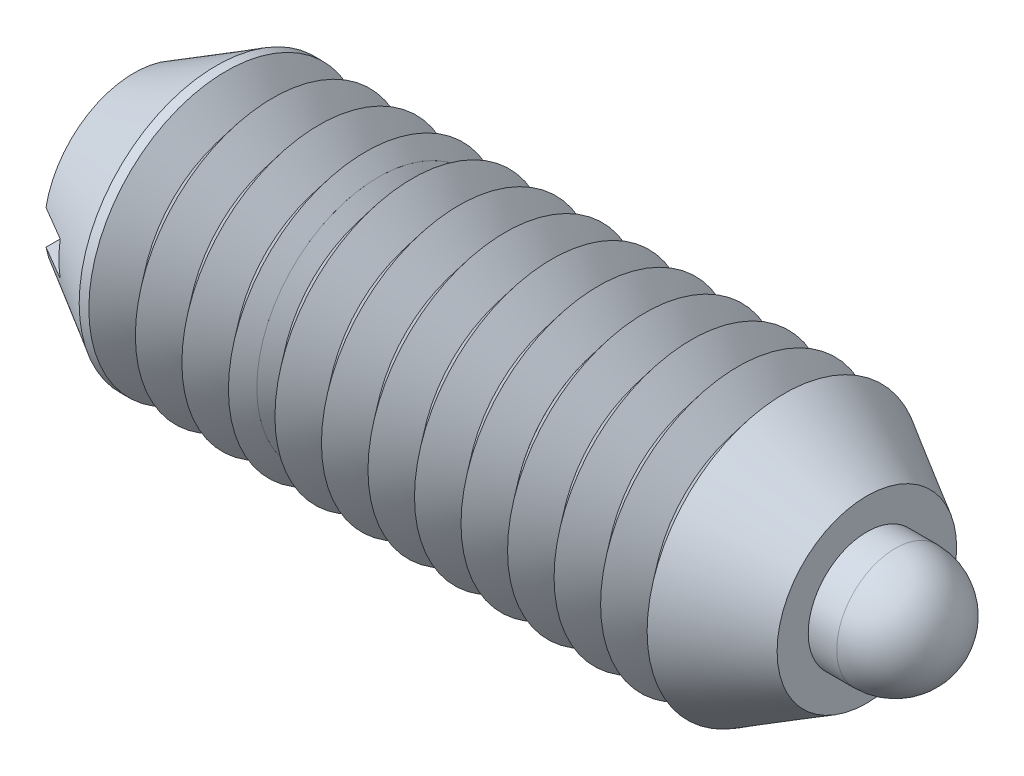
ISO-10303-21;
HEADER;
FILE_DESCRIPTION(('STEP AP214'),'2;1');
FILE_NAME('part.step','',(''),(''),'','','');
FILE_SCHEMA(('AUTOMOTIVE_DESIGN { 1 0 10303 214 1 1 1 1 }'));
ENDSEC;
DATA;
#1=APPLICATION_CONTEXT('core data for automotive mechanical design processes');
#2=APPLICATION_PROTOCOL_DEFINITION('international standard','automotive_design',2000,#1);
#3=PRODUCT_CONTEXT('',#1,'mechanical');
#4=PRODUCT('Part','Part','',(#3));
#5=PRODUCT_RELATED_PRODUCT_CATEGORY('part','',(#4));
#6=PRODUCT_DEFINITION_FORMATION('','',#4);
#7=PRODUCT_DEFINITION_CONTEXT('part definition',#1,'design');
#8=PRODUCT_DEFINITION('design','',#6,#7);
#9=PRODUCT_DEFINITION_SHAPE('','',#8);
#10=(LENGTH_UNIT() NAMED_UNIT(*) SI_UNIT(.MILLI.,.METRE.));
#11=(NAMED_UNIT(*) PLANE_ANGLE_UNIT() SI_UNIT($,.RADIAN.));
#12=(NAMED_UNIT(*) SI_UNIT($,.STERADIAN.) SOLID_ANGLE_UNIT());
#13=UNCERTAINTY_MEASURE_WITH_UNIT(LENGTH_MEASURE(1.E-05),#10,'distance_accuracy_value','');
#14=(GEOMETRIC_REPRESENTATION_CONTEXT(3) GLOBAL_UNCERTAINTY_ASSIGNED_CONTEXT((#13)) GLOBAL_UNIT_ASSIGNED_CONTEXT((#10,
#11,#12)) REPRESENTATION_CONTEXT('',''));
#15=CARTESIAN_POINT('',(0.,0.,0.));
#16=DIRECTION('',(0.,0.,1.));
#17=DIRECTION('',(1.,0.,0.));
#18=AXIS2_PLACEMENT_3D('',#15,#16,#17);
#19=CARTESIAN_POINT('',(9.0678,0.,0.));
#20=DIRECTION('',(-1.,0.,0.));
#21=DIRECTION('',(0.,-0.719424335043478,-0.694570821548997));
#22=AXIS2_PLACEMENT_3D('',#19,#20,#21);
#23=PLANE('',#22);
#24=CARTESIAN_POINT('',(9.0678,0.,0.));
#25=DIRECTION('',(1.,0.,0.));
#26=DIRECTION('',(0.,0.719424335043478,0.694570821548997));
#27=AXIS2_PLACEMENT_3D('',#24,#25,#26);
#28=CIRCLE('',#27,0.889);
#29=CARTESIAN_POINT('',(9.0678,0.639568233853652,0.617473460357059));
#30=VERTEX_POINT('',#29);
#31=EDGE_CURVE('P0_E10',#30,#30,#28,.T.);
#32=ORIENTED_EDGE('',*,*,#31,.F.);
#33=EDGE_LOOP('',(#32));
#34=FACE_BOUND('',#33,.T.);
#35=ADVANCED_FACE('P0_F14',(#34),#23,.T.);
#36=CARTESIAN_POINT('',(9.2456,0.,0.));
#37=DIRECTION('',(1.,0.,0.));
#38=DIRECTION('',(0.,0.719424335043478,0.694570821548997));
#39=AXIS2_PLACEMENT_3D('',#36,#37,#38);
#40=CONICAL_SURFACE('',#39,1.0668,0.78539816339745);
#41=ORIENTED_EDGE('',*,*,#31,.T.);
#42=EDGE_LOOP('',(#41));
#43=FACE_BOUND('',#42,.T.);
#44=CARTESIAN_POINT('',(9.2456,0.,0.));
#45=DIRECTION('',(1.,0.,0.));
#46=DIRECTION('',(0.,0.719424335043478,0.694570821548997));
#47=AXIS2_PLACEMENT_3D('',#44,#45,#46);
#48=CIRCLE('',#47,1.0668);
#49=CARTESIAN_POINT('',(9.2456,0.767481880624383,0.740968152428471));
#50=VERTEX_POINT('',#49);
#51=EDGE_CURVE('P0_E20',#50,#50,#48,.T.);
#52=ORIENTED_EDGE('',*,*,#51,.F.);
#53=EDGE_LOOP('',(#52));
#54=FACE_BOUND('',#53,.T.);
#55=ADVANCED_FACE('P0_F54',(#43,#54),#40,.T.);
#56=CARTESIAN_POINT('',(12.4333,0.,0.));
#57=DIRECTION('',(1.,0.,0.));
#58=DIRECTION('',(0.,0.719424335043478,0.694570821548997));
#59=AXIS2_PLACEMENT_3D('',#56,#57,#58);
#60=CYLINDRICAL_SURFACE('',#59,1.0668);
#61=ORIENTED_EDGE('',*,*,#51,.T.);
#62=EDGE_LOOP('',(#61));
#63=FACE_BOUND('',#62,.T.);
#64=CARTESIAN_POINT('',(10.5378413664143,0.,0.));
#65=DIRECTION('',(1.,0.,0.));
#66=DIRECTION('',(0.,0.719424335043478,0.694570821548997));
#67=AXIS2_PLACEMENT_3D('',#64,#65,#66);
#68=CIRCLE('',#67,1.0668);
#69=CARTESIAN_POINT('',(10.5378413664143,0.767481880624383,0.74096815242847));
#70=VERTEX_POINT('',#69);
#71=EDGE_CURVE('P0_E24',#70,#70,#68,.T.);
#72=ORIENTED_EDGE('',*,*,#71,.F.);
#73=EDGE_LOOP('',(#72));
#74=FACE_BOUND('',#73,.T.);
#75=ADVANCED_FACE('P0_F50',(#63,#74),#60,.T.);
#76=CARTESIAN_POINT('',(10.8458,0.,0.));
#77=DIRECTION('',(-1.,0.,0.));
#78=DIRECTION('',(0.,-0.719424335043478,-0.694570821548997));
#79=AXIS2_PLACEMENT_3D('',#76,#77,#78);
#80=CONICAL_SURFACE('',#79,0.889,0.523598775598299);
#81=ORIENTED_EDGE('',*,*,#71,.T.);
#82=EDGE_LOOP('',(#81));
#83=FACE_BOUND('',#82,.T.);
#84=CARTESIAN_POINT('',(10.8458,0.,0.));
#85=DIRECTION('',(1.,0.,0.));
#86=DIRECTION('',(0.,0.719424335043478,0.694570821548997));
#87=AXIS2_PLACEMENT_3D('',#84,#85,#86);
#88=CIRCLE('',#87,0.889);
#89=CARTESIAN_POINT('',(10.8458,0.639568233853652,0.617473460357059));
#90=VERTEX_POINT('',#89);
#91=EDGE_CURVE('P0_E28',#90,#90,#88,.T.);
#92=ORIENTED_EDGE('',*,*,#91,.F.);
#93=EDGE_LOOP('',(#92));
#94=FACE_BOUND('',#93,.T.);
#95=ADVANCED_FACE('P0_F41',(#83,#94),#80,.T.);
#96=CARTESIAN_POINT('',(12.4333,0.,0.));
#97=DIRECTION('',(1.,0.,0.));
#98=DIRECTION('',(0.,0.719424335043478,0.694570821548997));
#99=AXIS2_PLACEMENT_3D('',#96,#97,#98);
#100=CYLINDRICAL_SURFACE('',#99,0.889);
#101=ORIENTED_EDGE('',*,*,#91,.T.);
#102=EDGE_LOOP('',(#101));
#103=FACE_BOUND('',#102,.T.);
#104=CARTESIAN_POINT('',(11.5443,0.,0.));
#105=DIRECTION('',(1.,0.,0.));
#106=DIRECTION('',(0.,0.719424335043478,0.694570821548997));
#107=AXIS2_PLACEMENT_3D('',#104,#105,#106);
#108=CIRCLE('',#107,0.889);
#109=CARTESIAN_POINT('',(11.5443,0.639568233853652,0.617473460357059));
#110=VERTEX_POINT('',#109);
#111=EDGE_CURVE('P0_E33',#110,#110,#108,.T.);
#112=ORIENTED_EDGE('',*,*,#111,.F.);
#113=EDGE_LOOP('',(#112));
#114=FACE_BOUND('',#113,.T.);
#115=ADVANCED_FACE('P0_F39',(#103,#114),#100,.T.);
#116=CARTESIAN_POINT('',(11.5443,0.,0.));
#117=DIRECTION('',(1.,0.,0.));
#118=DIRECTION('',(0.,-0.719424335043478,-0.694570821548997));
#119=AXIS2_PLACEMENT_3D('',#116,#117,#118);
#120=SPHERICAL_SURFACE('',#119,0.889);
#121=ORIENTED_EDGE('',*,*,#111,.T.);
#122=EDGE_LOOP('',(#121));
#123=FACE_BOUND('',#122,.T.);
#124=ADVANCED_FACE('P0_F37',(#123),#120,.T.);
#125=CLOSED_SHELL('',(#35,#55,#75,#95,#115,#124));
#126=MANIFOLD_SOLID_BREP('P0_B1',#125);
#127=CARTESIAN_POINT('',(3.70416666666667,4.1656,-2.0828));
#128=DIRECTION('',(-1.,0.,0.));
#129=DIRECTION('',(0.,-1.,0.));
#130=AXIS2_PLACEMENT_3D('',#127,#128,#129);
#131=PLANE('',#130);
#132=CARTESIAN_POINT('',(3.70416666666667,0.,0.));
#133=DIRECTION('',(-1.,0.,0.));
#134=DIRECTION('',(0.,-1.,0.));
#135=AXIS2_PLACEMENT_3D('',#132,#133,#134);
#136=CIRCLE('',#135,1.84380808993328);
#137=CARTESIAN_POINT('',(3.70416666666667,-1.84380808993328,0.));
#138=VERTEX_POINT('',#137);
#139=EDGE_CURVE('P1_E31',#138,#138,#136,.F.);
#140=ORIENTED_EDGE('',*,*,#139,.F.);
#141=EDGE_LOOP('',(#140));
#142=FACE_BOUND('',#141,.T.);
#143=CARTESIAN_POINT('',(3.70416666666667,0.,0.));
#144=DIRECTION('',(1.,0.,0.));
#145=DIRECTION('',(0.,0.,-1.));
#146=AXIS2_PLACEMENT_3D('',#143,#144,#145);
#147=CIRCLE('',#146,1.0922);
#148=CARTESIAN_POINT('',(3.70416666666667,0.,-1.0922));
#149=VERTEX_POINT('',#148);
#150=EDGE_CURVE('P1_E47',#149,#149,#147,.T.);
#151=ORIENTED_EDGE('',*,*,#150,.T.);
#152=EDGE_LOOP('',(#151));
#153=FACE_BOUND('',#152,.T.);
#154=ADVANCED_FACE('P1_F14',(#142,#153),#131,.T.);
#155=CARTESIAN_POINT('',(7.40833333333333,4.1656,-2.0828));
#156=DIRECTION('',(1.,0.,0.));
#157=DIRECTION('',(0.,1.,0.));
#158=AXIS2_PLACEMENT_3D('',#155,#156,#157);
#159=PLANE('',#158);
#160=CARTESIAN_POINT('',(7.40833333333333,0.,0.));
#161=DIRECTION('',(1.,0.,0.));
#162=DIRECTION('',(0.,1.,0.));
#163=AXIS2_PLACEMENT_3D('',#160,#161,#162);
#164=CIRCLE('',#163,1.66086295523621);
#165=CARTESIAN_POINT('',(7.40833333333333,1.66086295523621,0.));
#166=VERTEX_POINT('',#165);
#167=EDGE_CURVE('P1_E33',#166,#166,#164,.F.);
#168=ORIENTED_EDGE('',*,*,#167,.F.);
#169=EDGE_LOOP('',(#168));
#170=FACE_BOUND('',#169,.T.);
#171=CARTESIAN_POINT('',(7.40833333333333,0.,0.));
#172=DIRECTION('',(1.,0.,0.));
#173=DIRECTION('',(0.,1.,0.));
#174=AXIS2_PLACEMENT_3D('',#171,#172,#173);
#175=CIRCLE('',#174,1.0922);
#176=CARTESIAN_POINT('',(7.40833333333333,1.0922,0.));
#177=VERTEX_POINT('',#176);
#178=EDGE_CURVE('P1_E18',#177,#177,#175,.F.);
#179=ORIENTED_EDGE('',*,*,#178,.T.);
#180=EDGE_LOOP('',(#179));
#181=FACE_BOUND('',#180,.T.);
#182=ADVANCED_FACE('P1_F83',(#170,#181),#159,.T.);
#183=CARTESIAN_POINT('',(5.27670888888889,0.,0.));
#184=DIRECTION('',(1.,0.,0.));
#185=DIRECTION('',(0.,0.,-1.));
#186=AXIS2_PLACEMENT_3D('',#183,#184,#185);
#187=CONICAL_SURFACE('',#186,1.64218069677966,0.895664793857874);
#188=CARTESIAN_POINT('',(5.62948666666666,0.,0.));
#189=DIRECTION('',(-1.,0.,0.));
#190=DIRECTION('',(0.,0.,1.));
#191=AXIS2_PLACEMENT_3D('',#188,#189,#190);
#192=CIRCLE('',#191,2.0828);
#193=CARTESIAN_POINT('',(5.62948666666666,0.,2.0828));
#194=VERTEX_POINT('',#193);
#195=EDGE_CURVE('P1_E54',#194,#194,#192,.T.);
#196=ORIENTED_EDGE('',*,*,#195,.T.);
#197=EDGE_LOOP('',(#196));
#198=FACE_BOUND('',#197,.T.);
#199=CARTESIAN_POINT('',(5.27670888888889,0.,0.));
#200=DIRECTION('',(-1.,0.,0.));
#201=DIRECTION('',(0.,0.,1.));
#202=AXIS2_PLACEMENT_3D('',#199,#200,#201);
#203=CIRCLE('',#202,1.64218069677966);
#204=CARTESIAN_POINT('',(5.27670888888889,0.,1.64218069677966));
#205=VERTEX_POINT('',#204);
#206=EDGE_CURVE('P1_E57',#205,#205,#203,.T.);
#207=ORIENTED_EDGE('',*,*,#206,.F.);
#208=EDGE_LOOP('',(#207));
#209=FACE_BOUND('',#208,.T.);
#210=ADVANCED_FACE('P1_F89',(#198,#209),#187,.T.);
#211=CARTESIAN_POINT('',(4.92393111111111,0.,0.));
#212=DIRECTION('',(-1.,0.,0.));
#213=DIRECTION('',(0.,0.,1.));
#214=AXIS2_PLACEMENT_3D('',#211,#212,#213);
#215=CONICAL_SURFACE('',#214,2.0828,0.895664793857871);
#216=ORIENTED_EDGE('',*,*,#206,.T.);
#217=EDGE_LOOP('',(#216));
#218=FACE_BOUND('',#217,.T.);
#219=CARTESIAN_POINT('',(4.92393111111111,0.,0.));
#220=DIRECTION('',(-1.,0.,0.));
#221=DIRECTION('',(0.,0.,1.));
#222=AXIS2_PLACEMENT_3D('',#219,#220,#221);
#223=CIRCLE('',#222,2.0828);
#224=CARTESIAN_POINT('',(4.92393111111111,0.,2.0828));
#225=VERTEX_POINT('',#224);
#226=EDGE_CURVE('P1_E44',#225,#225,#223,.T.);
#227=ORIENTED_EDGE('',*,*,#226,.F.);
#228=EDGE_LOOP('',(#227));
#229=FACE_BOUND('',#228,.T.);
#230=ADVANCED_FACE('P1_F111',(#218,#229),#215,.T.);
#231=CARTESIAN_POINT('',(4.57115333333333,0.,0.));
#232=DIRECTION('',(1.,0.,0.));
#233=DIRECTION('',(0.,0.,-1.));
#234=AXIS2_PLACEMENT_3D('',#231,#232,#233);
#235=CONICAL_SURFACE('',#234,1.64218069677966,0.895664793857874);
#236=ORIENTED_EDGE('',*,*,#226,.T.);
#237=EDGE_LOOP('',(#236));
#238=FACE_BOUND('',#237,.T.);
#239=CARTESIAN_POINT('',(4.57115333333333,0.,0.));
#240=DIRECTION('',(-1.,0.,0.));
#241=DIRECTION('',(0.,0.,1.));
#242=AXIS2_PLACEMENT_3D('',#239,#240,#241);
#243=CIRCLE('',#242,1.64218069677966);
#244=CARTESIAN_POINT('',(4.57115333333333,0.,1.64218069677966));
#245=VERTEX_POINT('',#244);
#246=EDGE_CURVE('P1_E51',#245,#245,#243,.T.);
#247=ORIENTED_EDGE('',*,*,#246,.F.);
#248=EDGE_LOOP('',(#247));
#249=FACE_BOUND('',#248,.T.);
#250=ADVANCED_FACE('P1_F107',(#238,#249),#235,.T.);
#251=CARTESIAN_POINT('',(4.21837555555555,0.,0.));
#252=DIRECTION('',(-1.,0.,0.));
#253=DIRECTION('',(0.,0.,1.));
#254=AXIS2_PLACEMENT_3D('',#251,#252,#253);
#255=CONICAL_SURFACE('',#254,2.0828,0.895664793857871);
#256=ORIENTED_EDGE('',*,*,#246,.T.);
#257=EDGE_LOOP('',(#256));
#258=FACE_BOUND('',#257,.T.);
#259=CARTESIAN_POINT('',(4.21837555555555,0.,0.));
#260=DIRECTION('',(-1.,0.,0.));
#261=DIRECTION('',(0.,0.,1.));
#262=AXIS2_PLACEMENT_3D('',#259,#260,#261);
#263=CIRCLE('',#262,2.0828);
#264=CARTESIAN_POINT('',(4.21837555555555,0.,2.0828));
#265=VERTEX_POINT('',#264);
#266=EDGE_CURVE('P1_E35',#265,#265,#263,.T.);
#267=ORIENTED_EDGE('',*,*,#266,.F.);
#268=EDGE_LOOP('',(#267));
#269=FACE_BOUND('',#268,.T.);
#270=ADVANCED_FACE('P1_F104',(#258,#269),#255,.T.);
#271=CARTESIAN_POINT('',(3.86559777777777,0.,0.));
#272=DIRECTION('',(1.,0.,0.));
#273=DIRECTION('',(0.,0.,-1.));
#274=AXIS2_PLACEMENT_3D('',#271,#272,#273);
#275=CONICAL_SURFACE('',#274,1.64218069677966,0.895664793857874);
#276=ORIENTED_EDGE('',*,*,#266,.T.);
#277=EDGE_LOOP('',(#276));
#278=FACE_BOUND('',#277,.T.);
#279=CARTESIAN_POINT('',(3.86559777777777,0.,0.));
#280=DIRECTION('',(-1.,0.,0.));
#281=DIRECTION('',(0.,0.,1.));
#282=AXIS2_PLACEMENT_3D('',#279,#280,#281);
#283=CIRCLE('',#282,1.64218069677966);
#284=CARTESIAN_POINT('',(3.86559777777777,0.,1.64218069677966));
#285=VERTEX_POINT('',#284);
#286=EDGE_CURVE('P1_E39',#285,#285,#283,.T.);
#287=ORIENTED_EDGE('',*,*,#286,.F.);
#288=EDGE_LOOP('',(#287));
#289=FACE_BOUND('',#288,.T.);
#290=ADVANCED_FACE('P1_F100',(#278,#289),#275,.T.);
#291=CARTESIAN_POINT('',(3.51282,0.,0.));
#292=DIRECTION('',(-1.,0.,0.));
#293=DIRECTION('',(0.,0.,1.));
#294=AXIS2_PLACEMENT_3D('',#291,#292,#293);
#295=CONICAL_SURFACE('',#294,2.0828,0.895664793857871);
#296=ORIENTED_EDGE('',*,*,#286,.T.);
#297=EDGE_LOOP('',(#296));
#298=FACE_BOUND('',#297,.T.);
#299=ORIENTED_EDGE('',*,*,#139,.T.);
#300=EDGE_LOOP('',(#299));
#301=FACE_BOUND('',#300,.T.);
#302=ADVANCED_FACE('P1_F96',(#298,#301),#295,.T.);
#303=CARTESIAN_POINT('',(5.62948666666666,0.,0.));
#304=DIRECTION('',(-1.,0.,0.));
#305=DIRECTION('',(0.,0.,1.));
#306=AXIS2_PLACEMENT_3D('',#303,#304,#305);
#307=CONICAL_SURFACE('',#306,2.0828,0.895664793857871);
#308=CARTESIAN_POINT('',(5.98226444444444,0.,0.));
#309=DIRECTION('',(-1.,0.,0.));
#310=DIRECTION('',(0.,0.,1.));
#311=AXIS2_PLACEMENT_3D('',#308,#309,#310);
#312=CIRCLE('',#311,1.64218069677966);
#313=CARTESIAN_POINT('',(5.98226444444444,0.,1.64218069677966));
#314=VERTEX_POINT('',#313);
#315=EDGE_CURVE('P1_E63',#314,#314,#312,.T.);
#316=ORIENTED_EDGE('',*,*,#315,.T.);
#317=EDGE_LOOP('',(#316));
#318=FACE_BOUND('',#317,.T.);
#319=ORIENTED_EDGE('',*,*,#195,.F.);
#320=EDGE_LOOP('',(#319));
#321=FACE_BOUND('',#320,.T.);
#322=ADVANCED_FACE('P1_F99',(#318,#321),#307,.T.);
#323=CARTESIAN_POINT('',(5.98226444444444,0.,0.));
#324=DIRECTION('',(1.,0.,0.));
#325=DIRECTION('',(0.,0.,-1.));
#326=AXIS2_PLACEMENT_3D('',#323,#324,#325);
#327=CONICAL_SURFACE('',#326,1.64218069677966,0.895664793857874);
#328=CARTESIAN_POINT('',(6.33504222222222,0.,0.));
#329=DIRECTION('',(-1.,0.,0.));
#330=DIRECTION('',(0.,0.,1.));
#331=AXIS2_PLACEMENT_3D('',#328,#329,#330);
#332=CIRCLE('',#331,2.0828);
#333=CARTESIAN_POINT('',(6.33504222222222,0.,2.0828));
#334=VERTEX_POINT('',#333);
#335=EDGE_CURVE('P1_E60',#334,#334,#332,.T.);
#336=ORIENTED_EDGE('',*,*,#335,.T.);
#337=EDGE_LOOP('',(#336));
#338=FACE_BOUND('',#337,.T.);
#339=ORIENTED_EDGE('',*,*,#315,.F.);
#340=EDGE_LOOP('',(#339));
#341=FACE_BOUND('',#340,.T.);
#342=ADVANCED_FACE('P1_F121',(#338,#341),#327,.T.);
#343=CARTESIAN_POINT('',(6.33504222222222,0.,0.));
#344=DIRECTION('',(-1.,0.,0.));
#345=DIRECTION('',(0.,0.,1.));
#346=AXIS2_PLACEMENT_3D('',#343,#344,#345);
#347=CONICAL_SURFACE('',#346,2.0828,0.895664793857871);
#348=CARTESIAN_POINT('',(6.68781999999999,0.,0.));
#349=DIRECTION('',(-1.,0.,0.));
#350=DIRECTION('',(0.,0.,1.));
#351=AXIS2_PLACEMENT_3D('',#348,#349,#350);
#352=CIRCLE('',#351,1.64218069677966);
#353=CARTESIAN_POINT('',(6.68781999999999,0.,1.64218069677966));
#354=VERTEX_POINT('',#353);
#355=EDGE_CURVE('P1_E22',#354,#354,#352,.T.);
#356=ORIENTED_EDGE('',*,*,#355,.T.);
#357=EDGE_LOOP('',(#356));
#358=FACE_BOUND('',#357,.T.);
#359=ORIENTED_EDGE('',*,*,#335,.F.);
#360=EDGE_LOOP('',(#359));
#361=FACE_BOUND('',#360,.T.);
#362=ADVANCED_FACE('P1_F80',(#358,#361),#347,.T.);
#363=CARTESIAN_POINT('',(6.68781999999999,0.,0.));
#364=DIRECTION('',(1.,0.,0.));
#365=DIRECTION('',(0.,0.,-1.));
#366=AXIS2_PLACEMENT_3D('',#363,#364,#365);
#367=CONICAL_SURFACE('',#366,1.64218069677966,0.895664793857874);
#368=CARTESIAN_POINT('',(7.04059777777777,0.,0.));
#369=DIRECTION('',(-1.,0.,0.));
#370=DIRECTION('',(0.,0.,1.));
#371=AXIS2_PLACEMENT_3D('',#368,#369,#370);
#372=CIRCLE('',#371,2.0828);
#373=CARTESIAN_POINT('',(7.04059777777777,0.,2.0828));
#374=VERTEX_POINT('',#373);
#375=EDGE_CURVE('P1_E27',#374,#374,#372,.T.);
#376=ORIENTED_EDGE('',*,*,#375,.T.);
#377=EDGE_LOOP('',(#376));
#378=FACE_BOUND('',#377,.T.);
#379=ORIENTED_EDGE('',*,*,#355,.F.);
#380=EDGE_LOOP('',(#379));
#381=FACE_BOUND('',#380,.T.);
#382=ADVANCED_FACE('P1_F68',(#378,#381),#367,.T.);
#383=CARTESIAN_POINT('',(7.04059777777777,0.,0.));
#384=DIRECTION('',(-1.,0.,0.));
#385=DIRECTION('',(0.,0.,1.));
#386=AXIS2_PLACEMENT_3D('',#383,#384,#385);
#387=CONICAL_SURFACE('',#386,2.0828,0.895664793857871);
#388=CARTESIAN_POINT('',(7.39337555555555,0.,0.));
#389=DIRECTION('',(-1.,0.,0.));
#390=DIRECTION('',(0.,0.,1.));
#391=AXIS2_PLACEMENT_3D('',#388,#389,#390);
#392=CIRCLE('',#391,1.64218069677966);
#393=CARTESIAN_POINT('',(7.39337555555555,0.,1.64218069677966));
#394=VERTEX_POINT('',#393);
#395=EDGE_CURVE('P1_E10',#394,#394,#392,.T.);
#396=ORIENTED_EDGE('',*,*,#395,.T.);
#397=EDGE_LOOP('',(#396));
#398=FACE_BOUND('',#397,.T.);
#399=ORIENTED_EDGE('',*,*,#375,.F.);
#400=EDGE_LOOP('',(#399));
#401=FACE_BOUND('',#400,.T.);
#402=ADVANCED_FACE('P1_F71',(#398,#401),#387,.T.);
#403=CARTESIAN_POINT('',(7.39337555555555,0.,0.));
#404=DIRECTION('',(1.,0.,0.));
#405=DIRECTION('',(0.,0.,-1.));
#406=AXIS2_PLACEMENT_3D('',#403,#404,#405);
#407=CONICAL_SURFACE('',#406,1.64218069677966,0.895664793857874);
#408=ORIENTED_EDGE('',*,*,#395,.F.);
#409=EDGE_LOOP('',(#408));
#410=FACE_BOUND('',#409,.T.);
#411=ORIENTED_EDGE('',*,*,#167,.T.);
#412=EDGE_LOOP('',(#411));
#413=FACE_BOUND('',#412,.T.);
#414=ADVANCED_FACE('P1_F16',(#410,#413),#407,.T.);
#415=CARTESIAN_POINT('',(11.1125,0.,0.));
#416=DIRECTION('',(-1.,0.,0.));
#417=DIRECTION('',(0.,0.,1.));
#418=AXIS2_PLACEMENT_3D('',#415,#416,#417);
#419=CYLINDRICAL_SURFACE('',#418,1.0922);
#420=ORIENTED_EDGE('',*,*,#178,.F.);
#421=EDGE_LOOP('',(#420));
#422=FACE_BOUND('',#421,.T.);
#423=ORIENTED_EDGE('',*,*,#150,.F.);
#424=EDGE_LOOP('',(#423));
#425=FACE_BOUND('',#424,.T.);
#426=ADVANCED_FACE('P1_F78',(#422,#425),#419,.F.);
#427=CLOSED_SHELL('',(#154,#182,#210,#230,#250,#270,#290,#302,#322,#342,#362,#382,#402,#414,#426));
#428=MANIFOLD_SOLID_BREP('P1_B1',#427);
#429=CARTESIAN_POINT('',(11.1125,0.,0.));
#430=DIRECTION('',(1.,0.,0.));
#431=DIRECTION('',(0.,0.,-1.));
#432=AXIS2_PLACEMENT_3D('',#429,#430,#431);
#433=PLANE('',#432);
#434=CARTESIAN_POINT('',(11.1125,0.,0.));
#435=DIRECTION('',(1.,0.,0.));
#436=DIRECTION('',(0.,0.,-1.));
#437=AXIS2_PLACEMENT_3D('',#434,#435,#436);
#438=CIRCLE('',#437,1.36129691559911);
#439=CARTESIAN_POINT('',(11.1125,0.,-1.36129691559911));
#440=VERTEX_POINT('',#439);
#441=EDGE_CURVE('P2_E79',#440,#440,#438,.T.);
#442=ORIENTED_EDGE('',*,*,#441,.T.);
#443=EDGE_LOOP('',(#442));
#444=FACE_BOUND('',#443,.T.);
#445=CARTESIAN_POINT('',(11.1125,0.,0.));
#446=DIRECTION('',(-1.,0.,0.));
#447=DIRECTION('',(0.,0.,1.));
#448=AXIS2_PLACEMENT_3D('',#445,#446,#447);
#449=CIRCLE('',#448,0.889);
#450=CARTESIAN_POINT('',(11.1125,0.,0.889));
#451=VERTEX_POINT('',#450);
#452=EDGE_CURVE('P2_E66',#451,#451,#449,.T.);
#453=ORIENTED_EDGE('',*,*,#452,.T.);
#454=EDGE_LOOP('',(#453));
#455=FACE_BOUND('',#454,.T.);
#456=ADVANCED_FACE('P2_F15',(#444,#455),#433,.T.);
#457=CARTESIAN_POINT('',(11.1125,0.,0.));
#458=DIRECTION('',(-1.,0.,0.));
#459=DIRECTION('',(0.,0.,1.));
#460=AXIS2_PLACEMENT_3D('',#457,#458,#459);
#461=CONICAL_SURFACE('',#460,1.36129691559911,0.523598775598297);
#462=CARTESIAN_POINT('',(9.86281999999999,0.,0.));
#463=DIRECTION('',(-1.,0.,0.));
#464=DIRECTION('',(0.,0.,1.));
#465=AXIS2_PLACEMENT_3D('',#462,#463,#464);
#466=CIRCLE('',#465,2.0828);
#467=CARTESIAN_POINT('',(9.86281999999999,0.,2.0828));
#468=VERTEX_POINT('',#467);
#469=EDGE_CURVE('P2_E160',#468,#468,#466,.T.);
#470=ORIENTED_EDGE('',*,*,#469,.F.);
#471=EDGE_LOOP('',(#470));
#472=FACE_BOUND('',#471,.T.);
#473=ORIENTED_EDGE('',*,*,#441,.F.);
#474=EDGE_LOOP('',(#473));
#475=FACE_BOUND('',#474,.T.);
#476=ADVANCED_FACE('P2_F17',(#472,#475),#461,.T.);
#477=CARTESIAN_POINT('',(0.,0.,0.));
#478=DIRECTION('',(-1.,0.,0.));
#479=DIRECTION('',(0.,0.,1.));
#480=AXIS2_PLACEMENT_3D('',#477,#478,#479);
#481=CYLINDRICAL_SURFACE('',#480,0.889);
#482=CARTESIAN_POINT('',(10.8458,0.,0.));
#483=DIRECTION('',(-1.,0.,0.));
#484=DIRECTION('',(0.,0.,1.));
#485=AXIS2_PLACEMENT_3D('',#482,#483,#484);
#486=CIRCLE('',#485,0.889);
#487=CARTESIAN_POINT('',(10.8458,0.,0.889));
#488=VERTEX_POINT('',#487);
#489=EDGE_CURVE('P2_E172',#488,#488,#486,.T.);
#490=ORIENTED_EDGE('',*,*,#489,.T.);
#491=EDGE_LOOP('',(#490));
#492=FACE_BOUND('',#491,.T.);
#493=ORIENTED_EDGE('',*,*,#452,.F.);
#494=EDGE_LOOP('',(#493));
#495=FACE_BOUND('',#494,.T.);
#496=ADVANCED_FACE('P2_F198',(#492,#495),#481,.F.);
#497=CARTESIAN_POINT('',(10.8458,0.,0.));
#498=DIRECTION('',(-1.,0.,0.));
#499=DIRECTION('',(0.,0.,1.));
#500=AXIS2_PLACEMENT_3D('',#497,#498,#499);
#501=CONICAL_SURFACE('',#500,0.889,0.78539816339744);
#502=CARTESIAN_POINT('',(10.668,0.,0.));
#503=DIRECTION('',(-1.,0.,0.));
#504=DIRECTION('',(0.,0.,1.));
#505=AXIS2_PLACEMENT_3D('',#502,#503,#504);
#506=CIRCLE('',#505,1.0668);
#507=CARTESIAN_POINT('',(10.668,0.,1.0668));
#508=VERTEX_POINT('',#507);
#509=EDGE_CURVE('P2_E169',#508,#508,#506,.T.);
#510=ORIENTED_EDGE('',*,*,#509,.T.);
#511=EDGE_LOOP('',(#510));
#512=FACE_BOUND('',#511,.T.);
#513=ORIENTED_EDGE('',*,*,#489,.F.);
#514=EDGE_LOOP('',(#513));
#515=FACE_BOUND('',#514,.T.);
#516=ADVANCED_FACE('P2_F205',(#512,#515),#501,.F.);
#517=CARTESIAN_POINT('',(0.,0.,0.));
#518=DIRECTION('',(-1.,0.,0.));
#519=DIRECTION('',(0.,0.,1.));
#520=AXIS2_PLACEMENT_3D('',#517,#518,#519);
#521=CYLINDRICAL_SURFACE('',#520,1.0668);
#522=CARTESIAN_POINT('',(1.5621,0.,0.));
#523=DIRECTION('',(-1.,0.,0.));
#524=DIRECTION('',(0.,0.,1.));
#525=AXIS2_PLACEMENT_3D('',#522,#523,#524);
#526=CIRCLE('',#525,1.0668);
#527=CARTESIAN_POINT('',(1.5621,0.,1.0668));
#528=VERTEX_POINT('',#527);
#529=EDGE_CURVE('P2_E166',#528,#528,#526,.T.);
#530=ORIENTED_EDGE('',*,*,#529,.T.);
#531=EDGE_LOOP('',(#530));
#532=FACE_BOUND('',#531,.T.);
#533=ORIENTED_EDGE('',*,*,#509,.F.);
#534=EDGE_LOOP('',(#533));
#535=FACE_BOUND('',#534,.T.);
#536=ADVANCED_FACE('P2_F210',(#532,#535),#521,.F.);
#537=CARTESIAN_POINT('',(1.5621,0.,0.));
#538=DIRECTION('',(1.,0.,0.));
#539=DIRECTION('',(0.,0.,-1.));
#540=AXIS2_PLACEMENT_3D('',#537,#538,#539);
#541=PLANE('',#540);
#542=ORIENTED_EDGE('',*,*,#529,.F.);
#543=EDGE_LOOP('',(#542));
#544=FACE_BOUND('',#543,.T.);
#545=ADVANCED_FACE('P2_F216',(#544),#541,.T.);
#546=CARTESIAN_POINT('',(9.51004222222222,0.,0.));
#547=DIRECTION('',(1.,0.,0.));
#548=DIRECTION('',(0.,0.,-1.));
#549=AXIS2_PLACEMENT_3D('',#546,#547,#548);
#550=CONICAL_SURFACE('',#549,1.64218069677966,0.895664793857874);
#551=ORIENTED_EDGE('',*,*,#469,.T.);
#552=EDGE_LOOP('',(#551));
#553=FACE_BOUND('',#552,.T.);
#554=CARTESIAN_POINT('',(9.51004222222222,0.,0.));
#555=DIRECTION('',(-1.,0.,0.));
#556=DIRECTION('',(0.,0.,1.));
#557=AXIS2_PLACEMENT_3D('',#554,#555,#556);
#558=CIRCLE('',#557,1.64218069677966);
#559=CARTESIAN_POINT('',(9.51004222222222,0.,1.64218069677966));
#560=VERTEX_POINT('',#559);
#561=EDGE_CURVE('P2_E163',#560,#560,#558,.T.);
#562=ORIENTED_EDGE('',*,*,#561,.F.);
#563=EDGE_LOOP('',(#562));
#564=FACE_BOUND('',#563,.T.);
#565=ADVANCED_FACE('P2_F220',(#553,#564),#550,.T.);
#566=CARTESIAN_POINT('',(9.15726444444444,0.,0.));
#567=DIRECTION('',(-1.,0.,0.));
#568=DIRECTION('',(0.,0.,1.));
#569=AXIS2_PLACEMENT_3D('',#566,#567,#568);
#570=CONICAL_SURFACE('',#569,2.0828,0.895664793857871);
#571=ORIENTED_EDGE('',*,*,#561,.T.);
#572=EDGE_LOOP('',(#571));
#573=FACE_BOUND('',#572,.T.);
#574=CARTESIAN_POINT('',(9.15726444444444,0.,0.));
#575=DIRECTION('',(-1.,0.,0.));
#576=DIRECTION('',(0.,0.,1.));
#577=AXIS2_PLACEMENT_3D('',#574,#575,#576);
#578=CIRCLE('',#577,2.0828);
#579=CARTESIAN_POINT('',(9.15726444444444,0.,2.0828));
#580=VERTEX_POINT('',#579);
#581=EDGE_CURVE('P2_E154',#580,#580,#578,.T.);
#582=ORIENTED_EDGE('',*,*,#581,.F.);
#583=EDGE_LOOP('',(#582));
#584=FACE_BOUND('',#583,.T.);
#585=ADVANCED_FACE('P2_F224',(#573,#584),#570,.T.);
#586=CARTESIAN_POINT('',(8.80448666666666,0.,0.));
#587=DIRECTION('',(1.,0.,0.));
#588=DIRECTION('',(0.,0.,-1.));
#589=AXIS2_PLACEMENT_3D('',#586,#587,#588);
#590=CONICAL_SURFACE('',#589,1.64218069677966,0.895664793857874);
#591=ORIENTED_EDGE('',*,*,#581,.T.);
#592=EDGE_LOOP('',(#591));
#593=FACE_BOUND('',#592,.T.);
#594=CARTESIAN_POINT('',(8.80448666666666,0.,0.));
#595=DIRECTION('',(-1.,0.,0.));
#596=DIRECTION('',(0.,0.,1.));
#597=AXIS2_PLACEMENT_3D('',#594,#595,#596);
#598=CIRCLE('',#597,1.64218069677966);
#599=CARTESIAN_POINT('',(8.80448666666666,0.,1.64218069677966));
#600=VERTEX_POINT('',#599);
#601=EDGE_CURVE('P2_E157',#600,#600,#598,.T.);
#602=ORIENTED_EDGE('',*,*,#601,.F.);
#603=EDGE_LOOP('',(#602));
#604=FACE_BOUND('',#603,.T.);
#605=ADVANCED_FACE('P2_F228',(#593,#604),#590,.T.);
#606=CARTESIAN_POINT('',(8.45170888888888,0.,0.));
#607=DIRECTION('',(-1.,0.,0.));
#608=DIRECTION('',(0.,0.,1.));
#609=AXIS2_PLACEMENT_3D('',#606,#607,#608);
#610=CONICAL_SURFACE('',#609,2.0828,0.895664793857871);
#611=ORIENTED_EDGE('',*,*,#601,.T.);
#612=EDGE_LOOP('',(#611));
#613=FACE_BOUND('',#612,.T.);
#614=CARTESIAN_POINT('',(8.45170888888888,0.,0.));
#615=DIRECTION('',(-1.,0.,0.));
#616=DIRECTION('',(0.,0.,1.));
#617=AXIS2_PLACEMENT_3D('',#614,#615,#616);
#618=CIRCLE('',#617,2.0828);
#619=CARTESIAN_POINT('',(8.45170888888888,0.,2.0828));
#620=VERTEX_POINT('',#619);
#621=EDGE_CURVE('P2_E148',#620,#620,#618,.T.);
#622=ORIENTED_EDGE('',*,*,#621,.F.);
#623=EDGE_LOOP('',(#622));
#624=FACE_BOUND('',#623,.T.);
#625=ADVANCED_FACE('P2_F232',(#613,#624),#610,.T.);
#626=CARTESIAN_POINT('',(8.09893111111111,0.,0.));
#627=DIRECTION('',(1.,0.,0.));
#628=DIRECTION('',(0.,0.,-1.));
#629=AXIS2_PLACEMENT_3D('',#626,#627,#628);
#630=CONICAL_SURFACE('',#629,1.64218069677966,0.895664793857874);
#631=ORIENTED_EDGE('',*,*,#621,.T.);
#632=EDGE_LOOP('',(#631));
#633=FACE_BOUND('',#632,.T.);
#634=CARTESIAN_POINT('',(8.09893111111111,0.,0.));
#635=DIRECTION('',(-1.,0.,0.));
#636=DIRECTION('',(0.,0.,1.));
#637=AXIS2_PLACEMENT_3D('',#634,#635,#636);
#638=CIRCLE('',#637,1.64218069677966);
#639=CARTESIAN_POINT('',(8.09893111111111,0.,1.64218069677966));
#640=VERTEX_POINT('',#639);
#641=EDGE_CURVE('P2_E151',#640,#640,#638,.T.);
#642=ORIENTED_EDGE('',*,*,#641,.F.);
#643=EDGE_LOOP('',(#642));
#644=FACE_BOUND('',#643,.T.);
#645=ADVANCED_FACE('P2_F236',(#633,#644),#630,.T.);
#646=CARTESIAN_POINT('',(7.74615333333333,0.,0.));
#647=DIRECTION('',(-1.,0.,0.));
#648=DIRECTION('',(0.,0.,1.));
#649=AXIS2_PLACEMENT_3D('',#646,#647,#648);
#650=CONICAL_SURFACE('',#649,2.0828,0.895664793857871);
#651=ORIENTED_EDGE('',*,*,#641,.T.);
#652=EDGE_LOOP('',(#651));
#653=FACE_BOUND('',#652,.T.);
#654=CARTESIAN_POINT('',(7.74615333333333,0.,0.));
#655=DIRECTION('',(-1.,0.,0.));
#656=DIRECTION('',(0.,0.,1.));
#657=AXIS2_PLACEMENT_3D('',#654,#655,#656);
#658=CIRCLE('',#657,2.0828);
#659=CARTESIAN_POINT('',(7.74615333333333,0.,2.0828));
#660=VERTEX_POINT('',#659);
#661=EDGE_CURVE('P2_E145',#660,#660,#658,.T.);
#662=ORIENTED_EDGE('',*,*,#661,.F.);
#663=EDGE_LOOP('',(#662));
#664=FACE_BOUND('',#663,.T.);
#665=ADVANCED_FACE('P2_F240',(#653,#664),#650,.T.);
#666=CARTESIAN_POINT('',(7.39337555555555,0.,0.));
#667=DIRECTION('',(1.,0.,0.));
#668=DIRECTION('',(0.,0.,-1.));
#669=AXIS2_PLACEMENT_3D('',#666,#667,#668);
#670=CONICAL_SURFACE('',#669,1.64218069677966,0.895664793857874);
#671=CARTESIAN_POINT('',(7.40833333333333,0.,0.));
#672=DIRECTION('',(1.,0.,0.));
#673=DIRECTION('',(0.,0.,-1.));
#674=AXIS2_PLACEMENT_3D('',#671,#672,#673);
#675=CIRCLE('',#674,1.66086295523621);
#676=CARTESIAN_POINT('',(7.40833333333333,0.,-1.66086295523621));
#677=VERTEX_POINT('',#676);
#678=EDGE_CURVE('P2_E19',#677,#677,#675,.F.);
#679=ORIENTED_EDGE('',*,*,#678,.F.);
#680=EDGE_LOOP('',(#679));
#681=FACE_BOUND('',#680,.T.);
#682=ORIENTED_EDGE('',*,*,#661,.T.);
#683=EDGE_LOOP('',(#682));
#684=FACE_BOUND('',#683,.T.);
#685=ADVANCED_FACE('P2_F244',(#681,#684),#670,.T.);
#686=CARTESIAN_POINT('',(3.70416666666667,0.,0.));
#687=DIRECTION('',(1.,0.,0.));
#688=DIRECTION('',(0.,0.,-1.));
#689=AXIS2_PLACEMENT_3D('',#686,#687,#688);
#690=PLANE('',#689);
#691=CARTESIAN_POINT('',(3.70416666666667,0.,0.));
#692=DIRECTION('',(1.,0.,0.));
#693=DIRECTION('',(0.,0.,-1.));
#694=AXIS2_PLACEMENT_3D('',#691,#692,#693);
#695=CIRCLE('',#694,1.84380808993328);
#696=CARTESIAN_POINT('',(3.70416666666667,0.,-1.84380808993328));
#697=VERTEX_POINT('',#696);
#698=EDGE_CURVE('P2_E110',#697,#697,#695,.F.);
#699=ORIENTED_EDGE('',*,*,#698,.F.);
#700=EDGE_LOOP('',(#699));
#701=FACE_BOUND('',#700,.T.);
#702=CARTESIAN_POINT('',(3.70416666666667,0.,0.));
#703=DIRECTION('',(1.,0.,0.));
#704=DIRECTION('',(0.,0.,-1.));
#705=AXIS2_PLACEMENT_3D('',#702,#703,#704);
#706=CIRCLE('',#705,1.0922);
#707=CARTESIAN_POINT('',(3.70416666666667,0.,-1.0922));
#708=VERTEX_POINT('',#707);
#709=EDGE_CURVE('P2_E112',#708,#708,#706,.T.);
#710=ORIENTED_EDGE('',*,*,#709,.F.);
#711=EDGE_LOOP('',(#710));
#712=FACE_BOUND('',#711,.T.);
#713=ADVANCED_FACE('P2_F248',(#701,#712),#690,.T.);
#714=CARTESIAN_POINT('',(13.440802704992,0.,0.));
#715=DIRECTION('',(-1.,0.,0.));
#716=DIRECTION('',(0.,0.,1.));
#717=AXIS2_PLACEMENT_3D('',#714,#715,#716);
#718=CYLINDRICAL_SURFACE('',#717,1.0922);
#719=ORIENTED_EDGE('',*,*,#709,.T.);
#720=EDGE_LOOP('',(#719));
#721=FACE_BOUND('',#720,.T.);
#722=CARTESIAN_POINT('',(7.40833333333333,0.,0.));
#723=DIRECTION('',(1.,0.,0.));
#724=DIRECTION('',(0.,0.,-1.));
#725=AXIS2_PLACEMENT_3D('',#722,#723,#724);
#726=CIRCLE('',#725,1.0922);
#727=CARTESIAN_POINT('',(7.40833333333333,0.,-1.0922));
#728=VERTEX_POINT('',#727);
#729=EDGE_CURVE('P2_E118',#728,#728,#726,.T.);
#730=ORIENTED_EDGE('',*,*,#729,.F.);
#731=EDGE_LOOP('',(#730));
#732=FACE_BOUND('',#731,.T.);
#733=ADVANCED_FACE('P2_F189',(#721,#732),#718,.T.);
#734=CARTESIAN_POINT('',(7.40833333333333,0.,0.));
#735=DIRECTION('',(1.,0.,0.));
#736=DIRECTION('',(0.,0.,-1.));
#737=AXIS2_PLACEMENT_3D('',#734,#735,#736);
#738=PLANE('',#737);
#739=ORIENTED_EDGE('',*,*,#678,.T.);
#740=EDGE_LOOP('',(#739));
#741=FACE_BOUND('',#740,.T.);
#742=ORIENTED_EDGE('',*,*,#729,.T.);
#743=EDGE_LOOP('',(#742));
#744=FACE_BOUND('',#743,.T.);
#745=ADVANCED_FACE('P2_F184',(#741,#744),#738,.F.);
#746=CARTESIAN_POINT('',(0.,0.,0.));
#747=DIRECTION('',(1.,0.,0.));
#748=DIRECTION('',(0.,0.,-1.));
#749=AXIS2_PLACEMENT_3D('',#746,#747,#748);
#750=PLANE('',#749);
#751=CARTESIAN_POINT('',(0.,0.,0.));
#752=DIRECTION('',(1.,0.,0.));
#753=DIRECTION('',(0.,0.,-1.));
#754=AXIS2_PLACEMENT_3D('',#751,#752,#753);
#755=CIRCLE('',#754,1.36129691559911);
#756=CARTESIAN_POINT('',(0.,-0.26035,-1.33616884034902));
#757=VERTEX_POINT('',#756);
#758=CARTESIAN_POINT('',(0.,-0.26035,1.33616884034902));
#759=VERTEX_POINT('',#758);
#760=EDGE_CURVE('P2_E75',#757,#759,#755,.F.);
#761=ORIENTED_EDGE('',*,*,#760,.T.);
#762=DIRECTION('',(0.,0.,1.));
#763=VECTOR('',#762,1.);
#764=CARTESIAN_POINT('',(0.,-0.26035,-2.0828));
#765=LINE('',#764,#763);
#766=EDGE_CURVE('P2_E33',#757,#759,#765,.T.);
#767=ORIENTED_EDGE('',*,*,#766,.F.);
#768=EDGE_LOOP('',(#761,#767));
#769=FACE_BOUND('',#768,.T.);
#770=ADVANCED_FACE('P2_F101',(#769),#750,.F.);
#771=CARTESIAN_POINT('',(0.,-0.26035,-2.0828));
#772=DIRECTION('',(0.,-1.,0.));
#773=DIRECTION('',(0.,0.,-1.));
#774=AXIS2_PLACEMENT_3D('',#771,#772,#773);
#775=PLANE('',#774);
#776=CARTESIAN_POINT('',(3.03971056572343,-0.26035,-3.10538007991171));
#777=CARTESIAN_POINT('',(2.73619356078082,-0.26035,-2.9295030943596));
#778=CARTESIAN_POINT('',(2.43269972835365,-0.26035,-2.75358610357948));
#779=CARTESIAN_POINT('',(1.82581746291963,-0.26035,-2.40143298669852));
#780=CARTESIAN_POINT('',(1.52242906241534,-0.26035,-2.22519680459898));
#781=CARTESIAN_POINT('',(0.923841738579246,-0.26035,-1.87683600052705));
#782=CARTESIAN_POINT('',(0.628635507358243,-0.26035,-1.70472396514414));
#783=CARTESIAN_POINT('',(0.186359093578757,-0.26035,-1.44570325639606));
#784=CARTESIAN_POINT('',(0.0390349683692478,-0.26035,-1.35922831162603));
#785=CARTESIAN_POINT('',(-0.255316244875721,-0.26035,-1.18577470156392));
#786=CARTESIAN_POINT('',(-0.402343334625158,-0.26035,-1.0987960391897));
#787=CARTESIAN_POINT('',(-0.622839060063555,-0.26035,-0.967335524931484));
#788=CARTESIAN_POINT('',(-0.696530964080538,-0.26035,-0.923228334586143));
#789=CARTESIAN_POINT('',(-0.843706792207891,-0.26035,-0.834610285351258));
#790=CARTESIAN_POINT('',(-0.91719063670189,-0.26035,-0.790099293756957));
#791=CARTESIAN_POINT('',(-1.06453357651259,-0.26035,-0.699987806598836));
#792=CARTESIAN_POINT('',(-1.13838868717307,-0.26035,-0.654380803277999));
#793=CARTESIAN_POINT('',(-1.28534608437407,-0.26035,-0.562114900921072));
#794=CARTESIAN_POINT('',(-1.35844905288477,-0.26035,-0.51545710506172));
#795=CARTESIAN_POINT('',(-1.46699058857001,-0.26035,-0.44371439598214));
#796=CARTESIAN_POINT('',(-1.50300072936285,-0.26035,-0.419496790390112));
#797=CARTESIAN_POINT('',(-1.57449047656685,-0.26035,-0.370070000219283));
#798=CARTESIAN_POINT('',(-1.60996835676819,-0.26035,-0.344858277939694));
#799=CARTESIAN_POINT('',(-1.66212735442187,-0.26035,-0.305972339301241));
#800=CARTESIAN_POINT('',(-1.67925518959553,-0.26035,-0.292899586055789));
#801=CARTESIAN_POINT('',(-1.71308292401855,-0.26035,-0.266214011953));
#802=CARTESIAN_POINT('',(-1.72978291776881,-0.26035,-0.252601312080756));
#803=CARTESIAN_POINT('',(-1.76246737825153,-0.26035,-0.224673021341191));
#804=CARTESIAN_POINT('',(-1.77845456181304,-0.26035,-0.210360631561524));
#805=CARTESIAN_POINT('',(-1.8093682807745,-0.26035,-0.180644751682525));
#806=CARTESIAN_POINT('',(-1.82429647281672,-0.26035,-0.165243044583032));
#807=CARTESIAN_POINT('',(-1.84830527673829,-0.26035,-0.137332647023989));
#808=CARTESIAN_POINT('',(-1.85784954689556,-0.26035,-0.12522888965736));
#809=CARTESIAN_POINT('',(-1.87526950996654,-0.26035,-0.0998803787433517));
#810=CARTESIAN_POINT('',(-1.88315152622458,-0.26035,-0.0866402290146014));
#811=CARTESIAN_POINT('',(-1.89362009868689,-0.26035,-0.0641663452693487));
#812=CARTESIAN_POINT('',(-1.89707777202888,-0.26035,-0.0553472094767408));
#813=CARTESIAN_POINT('',(-1.90255870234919,-0.26035,-0.0372693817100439));
#814=CARTESIAN_POINT('',(-1.90458387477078,-0.26035,-0.0280112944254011));
#815=CARTESIAN_POINT('',(-1.90690933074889,-0.26035,-0.0091896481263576));
#816=CARTESIAN_POINT('',(-1.90719465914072,-0.26035,0.000375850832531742));
#817=CARTESIAN_POINT('',(-1.90594810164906,-0.26035,0.0193849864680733));
#818=CARTESIAN_POINT('',(-1.904415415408,-0.26035,0.0288285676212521));
#819=CARTESIAN_POINT('',(-1.89930080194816,-0.26035,0.0492465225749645));
#820=CARTESIAN_POINT('',(-1.89535686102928,-0.26035,0.0601271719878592));
#821=CARTESIAN_POINT('',(-1.88583002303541,-0.26035,0.0811465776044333));
#822=CARTESIAN_POINT('',(-1.88024216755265,-0.26035,0.0912829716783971));
#823=CARTESIAN_POINT('',(-1.86616017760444,-0.26035,0.113752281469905));
#824=CARTESIAN_POINT('',(-1.85729534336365,-0.26035,0.12584751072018));
#825=CARTESIAN_POINT('',(-1.83844868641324,-0.26035,0.14914656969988));
#826=CARTESIAN_POINT('',(-1.8284644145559,-0.26035,0.160348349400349));
#827=CARTESIAN_POINT('',(-1.80771838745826,-0.26035,0.182146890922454));
#828=CARTESIAN_POINT('',(-1.79695173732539,-0.26035,0.192738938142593));
#829=CARTESIAN_POINT('',(-1.77494825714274,-0.26035,0.213391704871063));
#830=CARTESIAN_POINT('',(-1.76371196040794,-0.26035,0.223452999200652));
#831=CARTESIAN_POINT('',(-1.72699655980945,-0.26035,0.255225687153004));
#832=CARTESIAN_POINT('',(-1.70086338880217,-0.26035,0.276176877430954));
#833=CARTESIAN_POINT('',(-1.64774249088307,-0.26035,0.316973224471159));
#834=CARTESIAN_POINT('',(-1.6207542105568,-0.26035,0.336817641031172));
#835=CARTESIAN_POINT('',(-1.56621112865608,-0.26035,0.375819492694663));
#836=CARTESIAN_POINT('',(-1.53865536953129,-0.26035,0.394975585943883));
#837=CARTESIAN_POINT('',(-1.48320590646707,-0.26035,0.43279358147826));
#838=CARTESIAN_POINT('',(-1.45531217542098,-0.26035,0.451455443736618));
#839=CARTESIAN_POINT('',(-1.37141571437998,-0.26035,0.506836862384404));
#840=CARTESIAN_POINT('',(-1.3150724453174,-0.26035,0.543039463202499));
#841=CARTESIAN_POINT('',(-1.20196774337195,-0.26035,0.614629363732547));
#842=CARTESIAN_POINT('',(-1.14520688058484,-0.26035,0.650017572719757));
#843=CARTESIAN_POINT('',(-0.975156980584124,-0.26035,0.755060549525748));
#844=CARTESIAN_POINT('',(-0.861438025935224,-0.26035,0.824018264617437));
#845=CARTESIAN_POINT('',(-0.633489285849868,-0.26035,0.961087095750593));
#846=CARTESIAN_POINT('',(-0.51925948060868,-0.26035,1.02919817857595));
#847=CARTESIAN_POINT('',(-0.290453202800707,-0.26035,1.16497012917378));
#848=CARTESIAN_POINT('',(-0.175876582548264,-0.26035,1.23263074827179));
#849=CARTESIAN_POINT('',(0.0534476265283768,-0.26035,1.36765677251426));
#850=CARTESIAN_POINT('',(0.168195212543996,-0.26035,1.43502218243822));
#851=CARTESIAN_POINT('',(0.512461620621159,-0.26035,1.63675212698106));
#852=CARTESIAN_POINT('',(0.742145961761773,-0.26035,1.77083413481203));
#853=CARTESIAN_POINT('',(1.20169275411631,-0.26035,2.03861386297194));
#854=CARTESIAN_POINT('',(1.43155517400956,-0.26035,2.17231163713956));
#855=CARTESIAN_POINT('',(1.77626909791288,-0.26035,2.37259626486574));
#856=CARTESIAN_POINT('',(1.89107369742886,-0.26035,2.43926383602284));
#857=CARTESIAN_POINT('',(2.12071173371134,-0.26035,2.57255910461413));
#858=CARTESIAN_POINT('',(2.23554517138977,-0.26035,2.63918680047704));
#859=CARTESIAN_POINT('',(2.46526042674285,-0.26035,2.77242550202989));
#860=CARTESIAN_POINT('',(2.58014224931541,-0.26035,2.83903649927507));
#861=CARTESIAN_POINT('',(2.80991750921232,-0.26035,2.97222858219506));
#862=CARTESIAN_POINT('',(2.92481094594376,-0.26035,3.03880966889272));
#863=CARTESIAN_POINT('',(3.03971056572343,-0.26035,3.10538007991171));
#864=B_SPLINE_CURVE_WITH_KNOTS('',3,(#776,#777,#778,#779,#780,#781,#782,#783,#784,#785,#786,
#787,#788,#789,#790,#791,#792,#793,#794,#795,#796,#797,#798,#799,#800,#801,#802,#803,#804,#805,
#806,#807,#808,#809,#810,#811,#812,#813,#814,#815,#816,#817,#818,#819,#820,#821,#822,#823,#824,
#825,#826,#827,#828,#829,#830,#831,#832,#833,#834,#835,#836,#837,#838,#839,#840,#841,#842,#843,
#844,#845,#846,#847,#848,#849,#850,#851,#852,#853,#854,#855,#856,#857,#858,#859,#860,#861,#862,
#863),.UNSPECIFIED.,.F.,.F.,(4,2,2,2,2,2,2,2,2,2,2,2,2,2,2,2,2,2,2,2,2,2,2,2,2,2,2,2,2,2,2,2,2,
2,2,2,2,2,2,2,2,2,2,4),(0.,1.05237703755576,2.10496120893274,3.13010514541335,3.64258983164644,
4.15507155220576,4.41272093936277,4.67045831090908,4.93086252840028,5.19100504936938,
5.32118736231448,5.45172676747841,5.51635986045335,5.58097855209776,5.64532514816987,
5.7095687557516,5.75574056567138,5.80173343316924,5.83005964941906,5.85834791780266,
5.88687900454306,5.91542265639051,5.9499455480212,5.98457365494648,6.02944937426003,
6.07442526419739,6.11971188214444,6.1649484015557,6.26536678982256,6.36585155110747,
6.46652260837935,6.56720179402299,6.76810239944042,6.96876659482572,7.3677344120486,
7.76671783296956,8.16590577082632,8.5650872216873,9.3629558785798,10.16070667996,
10.5589803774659,10.9572688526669,11.3556577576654,11.7540318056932),.UNSPECIFIED.);
#865=CARTESIAN_POINT('',(0.5207,-0.26035,-1.64140385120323));
#866=VERTEX_POINT('',#865);
#867=EDGE_CURVE('P2_E92',#866,#757,#864,.T.);
#868=ORIENTED_EDGE('',*,*,#867,.T.);
#869=ORIENTED_EDGE('',*,*,#766,.T.);
#870=CARTESIAN_POINT('',(0.5207,-0.26035,1.64140385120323));
#871=VERTEX_POINT('',#870);
#872=EDGE_CURVE('P2_E86',#759,#871,#864,.T.);
#873=ORIENTED_EDGE('',*,*,#872,.T.);
#874=DIRECTION('',(0.,0.,1.));
#875=VECTOR('',#874,1.);
#876=CARTESIAN_POINT('',(0.5207,-0.26035,-2.0828));
#877=LINE('',#876,#875);
#878=EDGE_CURVE('P2_E178',#866,#871,#877,.T.);
#879=ORIENTED_EDGE('',*,*,#878,.F.);
#880=EDGE_LOOP('',(#868,#869,#873,#879));
#881=FACE_BOUND('',#880,.T.);
#882=ADVANCED_FACE('P2_F95',(#881),#775,.F.);
#883=CARTESIAN_POINT('',(0.5207,0.26035,-2.0828));
#884=DIRECTION('',(1.,0.,0.));
#885=DIRECTION('',(0.,0.,-1.));
#886=AXIS2_PLACEMENT_3D('',#883,#884,#885);
#887=PLANE('',#886);
#888=CARTESIAN_POINT('',(0.5207,0.,0.));
#889=DIRECTION('',(1.,0.,0.));
#890=DIRECTION('',(0.,0.,-1.));
#891=AXIS2_PLACEMENT_3D('',#888,#889,#890);
#892=CIRCLE('',#891,1.66192320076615);
#893=CARTESIAN_POINT('',(0.5207,0.26035,1.64140385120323));
#894=VERTEX_POINT('',#893);
#895=EDGE_CURVE('P2_E41',#871,#894,#892,.F.);
#896=ORIENTED_EDGE('',*,*,#895,.T.);
#897=DIRECTION('',(0.,0.,1.));
#898=VECTOR('',#897,1.);
#899=CARTESIAN_POINT('',(0.5207,0.26035,-2.0828));
#900=LINE('',#899,#898);
#901=CARTESIAN_POINT('',(0.5207,0.26035,-1.64140385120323));
#902=VERTEX_POINT('',#901);
#903=EDGE_CURVE('P2_E81',#902,#894,#900,.T.);
#904=ORIENTED_EDGE('',*,*,#903,.F.);
#905=EDGE_CURVE('P2_E24',#902,#866,#892,.F.);
#906=ORIENTED_EDGE('',*,*,#905,.T.);
#907=ORIENTED_EDGE('',*,*,#878,.T.);
#908=EDGE_LOOP('',(#896,#904,#906,#907));
#909=FACE_BOUND('',#908,.T.);
#910=ADVANCED_FACE('P2_F100',(#909),#887,.F.);
#911=CARTESIAN_POINT('',(0.,0.26035,1.33616884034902));
#912=VERTEX_POINT('',#911);
#913=CARTESIAN_POINT('',(0.,0.26035,-1.33616884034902));
#914=VERTEX_POINT('',#913);
#915=EDGE_CURVE('P2_E72',#912,#914,#755,.F.);
#916=ORIENTED_EDGE('',*,*,#915,.T.);
#917=DIRECTION('',(0.,0.,1.));
#918=VECTOR('',#917,1.);
#919=CARTESIAN_POINT('',(0.,0.26035,-2.0828));
#920=LINE('',#919,#918);
#921=EDGE_CURVE('P2_E59',#914,#912,#920,.T.);
#922=ORIENTED_EDGE('',*,*,#921,.T.);
#923=EDGE_LOOP('',(#916,#922));
#924=FACE_BOUND('',#923,.T.);
#925=ADVANCED_FACE('P2_F74',(#924),#750,.F.);
#926=CARTESIAN_POINT('',(0.,0.26035,-2.0828));
#927=DIRECTION('',(0.,1.,0.));
#928=DIRECTION('',(0.,0.,1.));
#929=AXIS2_PLACEMENT_3D('',#926,#927,#928);
#930=PLANE('',#929);
#931=CARTESIAN_POINT('',(3.03971056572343,0.26035,3.10538007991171));
#932=CARTESIAN_POINT('',(2.73619356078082,0.26035,2.9295030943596));
#933=CARTESIAN_POINT('',(2.43269972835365,0.26035,2.75358610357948));
#934=CARTESIAN_POINT('',(1.82581746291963,0.26035,2.40143298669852));
#935=CARTESIAN_POINT('',(1.52242906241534,0.26035,2.22519680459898));
#936=CARTESIAN_POINT('',(0.923841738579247,0.26035,1.87683600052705));
#937=CARTESIAN_POINT('',(0.628635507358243,0.26035,1.70472396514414));
#938=CARTESIAN_POINT('',(0.186359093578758,0.26035,1.44570325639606));
#939=CARTESIAN_POINT('',(0.0390349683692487,0.26035,1.35922831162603));
#940=CARTESIAN_POINT('',(-0.25531624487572,0.26035,1.18577470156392));
#941=CARTESIAN_POINT('',(-0.402343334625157,0.26035,1.0987960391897));
#942=CARTESIAN_POINT('',(-0.622839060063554,0.26035,0.967335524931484));
#943=CARTESIAN_POINT('',(-0.696530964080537,0.26035,0.923228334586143));
#944=CARTESIAN_POINT('',(-0.84370679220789,0.26035,0.834610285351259));
#945=CARTESIAN_POINT('',(-0.917190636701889,0.26035,0.790099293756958));
#946=CARTESIAN_POINT('',(-1.06453357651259,0.26035,0.699987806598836));
#947=CARTESIAN_POINT('',(-1.13838868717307,0.26035,0.654380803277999));
#948=CARTESIAN_POINT('',(-1.28534608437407,0.26035,0.562114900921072));
#949=CARTESIAN_POINT('',(-1.35844905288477,0.26035,0.51545710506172));
#950=CARTESIAN_POINT('',(-1.46699058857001,0.26035,0.44371439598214));
#951=CARTESIAN_POINT('',(-1.50300072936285,0.26035,0.419496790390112));
#952=CARTESIAN_POINT('',(-1.57449047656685,0.26035,0.370070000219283));
#953=CARTESIAN_POINT('',(-1.60996835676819,0.26035,0.344858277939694));
#954=CARTESIAN_POINT('',(-1.66212735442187,0.26035,0.305972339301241));
#955=CARTESIAN_POINT('',(-1.67925518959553,0.26035,0.292899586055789));
#956=CARTESIAN_POINT('',(-1.71308292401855,0.26035,0.266214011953));
#957=CARTESIAN_POINT('',(-1.72978291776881,0.26035,0.252601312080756));
#958=CARTESIAN_POINT('',(-1.76246737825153,0.26035,0.22467302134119));
#959=CARTESIAN_POINT('',(-1.77845456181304,0.26035,0.210360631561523));
#960=CARTESIAN_POINT('',(-1.8093682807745,0.26035,0.180644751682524));
#961=CARTESIAN_POINT('',(-1.82429647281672,0.26035,0.165243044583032));
#962=CARTESIAN_POINT('',(-1.84830527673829,0.26035,0.137332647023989));
#963=CARTESIAN_POINT('',(-1.85784954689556,0.26035,0.12522888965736));
#964=CARTESIAN_POINT('',(-1.87526950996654,0.26035,0.0998803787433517));
#965=CARTESIAN_POINT('',(-1.88315152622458,0.26035,0.0866402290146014));
#966=CARTESIAN_POINT('',(-1.89362009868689,0.26035,0.0641663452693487));
#967=CARTESIAN_POINT('',(-1.89707777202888,0.26035,0.0553472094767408));
#968=CARTESIAN_POINT('',(-1.90255870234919,0.26035,0.0372693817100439));
#969=CARTESIAN_POINT('',(-1.90458387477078,0.26035,0.0280112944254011));
#970=CARTESIAN_POINT('',(-1.90690933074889,0.26035,0.0091896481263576));
#971=CARTESIAN_POINT('',(-1.90719465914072,0.26035,-0.000375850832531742));
#972=CARTESIAN_POINT('',(-1.90594810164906,0.26035,-0.0193849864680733));
#973=CARTESIAN_POINT('',(-1.904415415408,0.26035,-0.0288285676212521));
#974=CARTESIAN_POINT('',(-1.89930080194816,0.26035,-0.0492465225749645));
#975=CARTESIAN_POINT('',(-1.89535686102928,0.26035,-0.0601271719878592));
#976=CARTESIAN_POINT('',(-1.88583002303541,0.26035,-0.0811465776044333));
#977=CARTESIAN_POINT('',(-1.88024216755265,0.26035,-0.0912829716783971));
#978=CARTESIAN_POINT('',(-1.86616017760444,0.26035,-0.113752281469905));
#979=CARTESIAN_POINT('',(-1.85729534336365,0.26035,-0.12584751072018));
#980=CARTESIAN_POINT('',(-1.83844868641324,0.26035,-0.14914656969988));
#981=CARTESIAN_POINT('',(-1.8284644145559,0.26035,-0.160348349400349));
#982=CARTESIAN_POINT('',(-1.80771838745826,0.26035,-0.182146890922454));
#983=CARTESIAN_POINT('',(-1.79695173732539,0.26035,-0.192738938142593));
#984=CARTESIAN_POINT('',(-1.77494825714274,0.26035,-0.213391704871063));
#985=CARTESIAN_POINT('',(-1.76371196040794,0.26035,-0.223452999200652));
#986=CARTESIAN_POINT('',(-1.72699655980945,0.26035,-0.255225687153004));
#987=CARTESIAN_POINT('',(-1.70086338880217,0.26035,-0.276176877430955));
#988=CARTESIAN_POINT('',(-1.64774249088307,0.26035,-0.316973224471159));
#989=CARTESIAN_POINT('',(-1.6207542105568,0.26035,-0.336817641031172));
#990=CARTESIAN_POINT('',(-1.56621112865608,0.26035,-0.375819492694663));
#991=CARTESIAN_POINT('',(-1.53865536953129,0.26035,-0.394975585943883));
#992=CARTESIAN_POINT('',(-1.48320590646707,0.26035,-0.43279358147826));
#993=CARTESIAN_POINT('',(-1.45531217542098,0.26035,-0.451455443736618));
#994=CARTESIAN_POINT('',(-1.37141571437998,0.26035,-0.506836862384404));
#995=CARTESIAN_POINT('',(-1.3150724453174,0.26035,-0.543039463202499));
#996=CARTESIAN_POINT('',(-1.20196774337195,0.26035,-0.614629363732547));
#997=CARTESIAN_POINT('',(-1.14520688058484,0.26035,-0.650017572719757));
#998=CARTESIAN_POINT('',(-0.975156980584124,0.26035,-0.755060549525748));
#999=CARTESIAN_POINT('',(-0.861438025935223,0.26035,-0.824018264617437));
#1000=CARTESIAN_POINT('',(-0.633489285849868,0.26035,-0.961087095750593));
#1001=CARTESIAN_POINT('',(-0.51925948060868,0.26035,-1.02919817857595));
#1002=CARTESIAN_POINT('',(-0.290453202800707,0.26035,-1.16497012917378));
#1003=CARTESIAN_POINT('',(-0.175876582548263,0.26035,-1.23263074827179));
#1004=CARTESIAN_POINT('',(0.0534476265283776,0.26035,-1.36765677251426));
#1005=CARTESIAN_POINT('',(0.168195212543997,0.26035,-1.43502218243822));
#1006=CARTESIAN_POINT('',(0.512461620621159,0.26035,-1.63675212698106));
#1007=CARTESIAN_POINT('',(0.742145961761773,0.26035,-1.77083413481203));
#1008=CARTESIAN_POINT('',(1.20169275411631,0.26035,-2.03861386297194));
#1009=CARTESIAN_POINT('',(1.43155517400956,0.26035,-2.17231163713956));
#1010=CARTESIAN_POINT('',(1.77626909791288,0.26035,-2.37259626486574));
#1011=CARTESIAN_POINT('',(1.89107369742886,0.26035,-2.43926383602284));
#1012=CARTESIAN_POINT('',(2.12071173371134,0.26035,-2.57255910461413));
#1013=CARTESIAN_POINT('',(2.23554517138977,0.26035,-2.63918680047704));
#1014=CARTESIAN_POINT('',(2.46526042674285,0.26035,-2.77242550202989));
#1015=CARTESIAN_POINT('',(2.58014224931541,0.26035,-2.83903649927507));
#1016=CARTESIAN_POINT('',(2.80991750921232,0.26035,-2.97222858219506));
#1017=CARTESIAN_POINT('',(2.92481094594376,0.26035,-3.03880966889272));
#1018=CARTESIAN_POINT('',(3.03971056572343,0.26035,-3.10538007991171));
#1019=B_SPLINE_CURVE_WITH_KNOTS('',3,(#931,#932,#933,#934,#935,#936,#937,#938,#939,#940,#941,
#942,#943,#944,#945,#946,#947,#948,#949,#950,#951,#952,#953,#954,#955,#956,#957,#958,#959,#960,
#961,#962,#963,#964,#965,#966,#967,#968,#969,#970,#971,#972,#973,#974,#975,#976,#977,#978,#979,
#980,#981,#982,#983,#984,#985,#986,#987,#988,#989,#990,#991,#992,#993,#994,#995,#996,#997,#998,
#999,#1000,#1001,#1002,#1003,#1004,#1005,#1006,#1007,#1008,#1009,#1010,#1011,#1012,#1013,#1014,
#1015,#1016,#1017,#1018),.UNSPECIFIED.,.F.,.F.,(4,2,2,2,2,2,2,2,2,2,2,2,2,2,2,2,2,2,2,2,2,2,2,2,
2,2,2,2,2,2,2,2,2,2,2,2,2,2,2,2,2,2,2,4),(0.,1.05237703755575,2.10496120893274,3.13010514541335,
3.64258983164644,4.15507155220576,4.41272093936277,4.67045831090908,4.93086252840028,
5.19100504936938,5.32118736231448,5.45172676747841,5.51635986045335,5.58097855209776,
5.64532514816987,5.7095687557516,5.75574056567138,5.80173343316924,5.83005964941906,
5.85834791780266,5.88687900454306,5.91542265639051,5.9499455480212,5.98457365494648,
6.02944937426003,6.07442526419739,6.11971188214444,6.1649484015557,6.26536678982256,
6.36585155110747,6.46652260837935,6.56720179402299,6.76810239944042,6.96876659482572,
7.3677344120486,7.76671783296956,8.16590577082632,8.56508722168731,9.3629558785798,
10.16070667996,10.5589803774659,10.9572688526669,11.3556577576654,11.7540318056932),.UNSPECIFIED.);
#1020=EDGE_CURVE('P2_E26',#894,#912,#1019,.T.);
#1021=ORIENTED_EDGE('',*,*,#1020,.T.);
#1022=ORIENTED_EDGE('',*,*,#921,.F.);
#1023=EDGE_CURVE('P2_E10',#914,#902,#1019,.T.);
#1024=ORIENTED_EDGE('',*,*,#1023,.T.);
#1025=ORIENTED_EDGE('',*,*,#903,.T.);
#1026=EDGE_LOOP('',(#1021,#1022,#1024,#1025));
#1027=FACE_BOUND('',#1026,.T.);
#1028=ADVANCED_FACE('P2_F61',(#1027),#930,.F.);
#1029=CARTESIAN_POINT('',(1.24968,0.,0.));
#1030=DIRECTION('',(1.,0.,0.));
#1031=DIRECTION('',(0.,0.,-1.));
#1032=AXIS2_PLACEMENT_3D('',#1029,#1030,#1031);
#1033=CONICAL_SURFACE('',#1032,2.0828,0.523598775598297);
#1034=ORIENTED_EDGE('',*,*,#1023,.F.);
#1035=ORIENTED_EDGE('',*,*,#915,.F.);
#1036=ORIENTED_EDGE('',*,*,#1020,.F.);
#1037=ORIENTED_EDGE('',*,*,#895,.F.);
#1038=ORIENTED_EDGE('',*,*,#872,.F.);
#1039=ORIENTED_EDGE('',*,*,#760,.F.);
#1040=ORIENTED_EDGE('',*,*,#867,.F.);
#1041=ORIENTED_EDGE('',*,*,#905,.F.);
#1042=EDGE_LOOP('',(#1034,#1035,#1036,#1037,#1038,#1039,#1040,#1041));
#1043=FACE_BOUND('',#1042,.T.);
#1044=CARTESIAN_POINT('',(1.24968,0.,0.));
#1045=DIRECTION('',(1.,0.,0.));
#1046=DIRECTION('',(0.,0.,-1.));
#1047=AXIS2_PLACEMENT_3D('',#1044,#1045,#1046);
#1048=CIRCLE('',#1047,2.0828);
#1049=CARTESIAN_POINT('',(1.24968,0.,-2.0828));
#1050=VERTEX_POINT('',#1049);
#1051=EDGE_CURVE('P2_E76',#1050,#1050,#1048,.T.);
#1052=ORIENTED_EDGE('',*,*,#1051,.F.);
#1053=EDGE_LOOP('',(#1052));
#1054=FACE_BOUND('',#1053,.T.);
#1055=ADVANCED_FACE('P2_F70',(#1043,#1054),#1033,.T.);
#1056=CARTESIAN_POINT('',(11.1125,0.,0.));
#1057=DIRECTION('',(-1.,0.,0.));
#1058=DIRECTION('',(0.,0.,1.));
#1059=AXIS2_PLACEMENT_3D('',#1056,#1057,#1058);
#1060=CYLINDRICAL_SURFACE('',#1059,2.0828);
#1061=ORIENTED_EDGE('',*,*,#1051,.T.);
#1062=EDGE_LOOP('',(#1061));
#1063=FACE_BOUND('',#1062,.T.);
#1064=CARTESIAN_POINT('',(1.39615333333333,0.,0.));
#1065=DIRECTION('',(-1.,0.,0.));
#1066=DIRECTION('',(0.,0.,1.));
#1067=AXIS2_PLACEMENT_3D('',#1064,#1065,#1066);
#1068=CIRCLE('',#1067,2.0828);
#1069=CARTESIAN_POINT('',(1.39615333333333,0.,2.0828));
#1070=VERTEX_POINT('',#1069);
#1071=EDGE_CURVE('P2_E127',#1070,#1070,#1068,.T.);
#1072=ORIENTED_EDGE('',*,*,#1071,.T.);
#1073=EDGE_LOOP('',(#1072));
#1074=FACE_BOUND('',#1073,.T.);
#1075=ADVANCED_FACE('P2_F277',(#1063,#1074),#1060,.T.);
#1076=CARTESIAN_POINT('',(1.39615333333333,0.,0.));
#1077=DIRECTION('',(-1.,0.,0.));
#1078=DIRECTION('',(0.,0.,1.));
#1079=AXIS2_PLACEMENT_3D('',#1076,#1077,#1078);
#1080=CONICAL_SURFACE('',#1079,2.0828,0.895664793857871);
#1081=CARTESIAN_POINT('',(1.74893111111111,0.,0.));
#1082=DIRECTION('',(-1.,0.,0.));
#1083=DIRECTION('',(0.,0.,1.));
#1084=AXIS2_PLACEMENT_3D('',#1081,#1082,#1083);
#1085=CIRCLE('',#1084,1.64218069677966);
#1086=CARTESIAN_POINT('',(1.74893111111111,0.,1.64218069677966));
#1087=VERTEX_POINT('',#1086);
#1088=EDGE_CURVE('P2_E130',#1087,#1087,#1085,.T.);
#1089=ORIENTED_EDGE('',*,*,#1088,.T.);
#1090=EDGE_LOOP('',(#1089));
#1091=FACE_BOUND('',#1090,.T.);
#1092=ORIENTED_EDGE('',*,*,#1071,.F.);
#1093=EDGE_LOOP('',(#1092));
#1094=FACE_BOUND('',#1093,.T.);
#1095=ADVANCED_FACE('P2_F273',(#1091,#1094),#1080,.T.);
#1096=CARTESIAN_POINT('',(1.74893111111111,0.,0.));
#1097=DIRECTION('',(1.,0.,0.));
#1098=DIRECTION('',(0.,0.,-1.));
#1099=AXIS2_PLACEMENT_3D('',#1096,#1097,#1098);
#1100=CONICAL_SURFACE('',#1099,1.64218069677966,0.895664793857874);
#1101=CARTESIAN_POINT('',(2.10170888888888,0.,0.));
#1102=DIRECTION('',(-1.,0.,0.));
#1103=DIRECTION('',(0.,0.,1.));
#1104=AXIS2_PLACEMENT_3D('',#1101,#1102,#1103);
#1105=CIRCLE('',#1104,2.0828);
#1106=CARTESIAN_POINT('',(2.10170888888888,0.,2.0828));
#1107=VERTEX_POINT('',#1106);
#1108=EDGE_CURVE('P2_E116',#1107,#1107,#1105,.T.);
#1109=ORIENTED_EDGE('',*,*,#1108,.T.);
#1110=EDGE_LOOP('',(#1109));
#1111=FACE_BOUND('',#1110,.T.);
#1112=ORIENTED_EDGE('',*,*,#1088,.F.);
#1113=EDGE_LOOP('',(#1112));
#1114=FACE_BOUND('',#1113,.T.);
#1115=ADVANCED_FACE('P2_F269',(#1111,#1114),#1100,.T.);
#1116=CARTESIAN_POINT('',(2.10170888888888,0.,0.));
#1117=DIRECTION('',(-1.,0.,0.));
#1118=DIRECTION('',(0.,0.,1.));
#1119=AXIS2_PLACEMENT_3D('',#1116,#1117,#1118);
#1120=CONICAL_SURFACE('',#1119,2.0828,0.895664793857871);
#1121=CARTESIAN_POINT('',(2.45448666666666,0.,0.));
#1122=DIRECTION('',(-1.,0.,0.));
#1123=DIRECTION('',(0.,0.,1.));
#1124=AXIS2_PLACEMENT_3D('',#1121,#1122,#1123);
#1125=CIRCLE('',#1124,1.64218069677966);
#1126=CARTESIAN_POINT('',(2.45448666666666,0.,1.64218069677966));
#1127=VERTEX_POINT('',#1126);
#1128=EDGE_CURVE('P2_E136',#1127,#1127,#1125,.T.);
#1129=ORIENTED_EDGE('',*,*,#1128,.T.);
#1130=EDGE_LOOP('',(#1129));
#1131=FACE_BOUND('',#1130,.T.);
#1132=ORIENTED_EDGE('',*,*,#1108,.F.);
#1133=EDGE_LOOP('',(#1132));
#1134=FACE_BOUND('',#1133,.T.);
#1135=ADVANCED_FACE('P2_F265',(#1131,#1134),#1120,.T.);
#1136=CARTESIAN_POINT('',(2.45448666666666,0.,0.));
#1137=DIRECTION('',(1.,0.,0.));
#1138=DIRECTION('',(0.,0.,-1.));
#1139=AXIS2_PLACEMENT_3D('',#1136,#1137,#1138);
#1140=CONICAL_SURFACE('',#1139,1.64218069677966,0.895664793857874);
#1141=CARTESIAN_POINT('',(2.80726444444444,0.,0.));
#1142=DIRECTION('',(-1.,0.,0.));
#1143=DIRECTION('',(0.,0.,1.));
#1144=AXIS2_PLACEMENT_3D('',#1141,#1142,#1143);
#1145=CIRCLE('',#1144,2.0828);
#1146=CARTESIAN_POINT('',(2.80726444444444,0.,2.0828));
#1147=VERTEX_POINT('',#1146);
#1148=EDGE_CURVE('P2_E133',#1147,#1147,#1145,.T.);
#1149=ORIENTED_EDGE('',*,*,#1148,.T.);
#1150=EDGE_LOOP('',(#1149));
#1151=FACE_BOUND('',#1150,.T.);
#1152=ORIENTED_EDGE('',*,*,#1128,.F.);
#1153=EDGE_LOOP('',(#1152));
#1154=FACE_BOUND('',#1153,.T.);
#1155=ADVANCED_FACE('P2_F261',(#1151,#1154),#1140,.T.);
#1156=CARTESIAN_POINT('',(2.80726444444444,0.,0.));
#1157=DIRECTION('',(-1.,0.,0.));
#1158=DIRECTION('',(0.,0.,1.));
#1159=AXIS2_PLACEMENT_3D('',#1156,#1157,#1158);
#1160=CONICAL_SURFACE('',#1159,2.0828,0.895664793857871);
#1161=CARTESIAN_POINT('',(3.16004222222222,0.,0.));
#1162=DIRECTION('',(-1.,0.,0.));
#1163=DIRECTION('',(0.,0.,1.));
#1164=AXIS2_PLACEMENT_3D('',#1161,#1162,#1163);
#1165=CIRCLE('',#1164,1.64218069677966);
#1166=CARTESIAN_POINT('',(3.16004222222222,0.,1.64218069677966));
#1167=VERTEX_POINT('',#1166);
#1168=EDGE_CURVE('P2_E142',#1167,#1167,#1165,.T.);
#1169=ORIENTED_EDGE('',*,*,#1168,.T.);
#1170=EDGE_LOOP('',(#1169));
#1171=FACE_BOUND('',#1170,.T.);
#1172=ORIENTED_EDGE('',*,*,#1148,.F.);
#1173=EDGE_LOOP('',(#1172));
#1174=FACE_BOUND('',#1173,.T.);
#1175=ADVANCED_FACE('P2_F257',(#1171,#1174),#1160,.T.);
#1176=CARTESIAN_POINT('',(3.16004222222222,0.,0.));
#1177=DIRECTION('',(1.,0.,0.));
#1178=DIRECTION('',(0.,0.,-1.));
#1179=AXIS2_PLACEMENT_3D('',#1176,#1177,#1178);
#1180=CONICAL_SURFACE('',#1179,1.64218069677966,0.895664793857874);
#1181=CARTESIAN_POINT('',(3.51281999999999,0.,0.));
#1182=DIRECTION('',(-1.,0.,0.));
#1183=DIRECTION('',(0.,0.,1.));
#1184=AXIS2_PLACEMENT_3D('',#1181,#1182,#1183);
#1185=CIRCLE('',#1184,2.0828);
#1186=CARTESIAN_POINT('',(3.51281999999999,0.,2.0828));
#1187=VERTEX_POINT('',#1186);
#1188=EDGE_CURVE('P2_E139',#1187,#1187,#1185,.T.);
#1189=ORIENTED_EDGE('',*,*,#1188,.T.);
#1190=EDGE_LOOP('',(#1189));
#1191=FACE_BOUND('',#1190,.T.);
#1192=ORIENTED_EDGE('',*,*,#1168,.F.);
#1193=EDGE_LOOP('',(#1192));
#1194=FACE_BOUND('',#1193,.T.);
#1195=ADVANCED_FACE('P2_F253',(#1191,#1194),#1180,.T.);
#1196=CARTESIAN_POINT('',(3.51282,0.,0.));
#1197=DIRECTION('',(-1.,0.,0.));
#1198=DIRECTION('',(0.,0.,1.));
#1199=AXIS2_PLACEMENT_3D('',#1196,#1197,#1198);
#1200=CONICAL_SURFACE('',#1199,2.0828,0.895664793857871);
#1201=ORIENTED_EDGE('',*,*,#1188,.F.);
#1202=EDGE_LOOP('',(#1201));
#1203=FACE_BOUND('',#1202,.T.);
#1204=ORIENTED_EDGE('',*,*,#698,.T.);
#1205=EDGE_LOOP('',(#1204));
#1206=FACE_BOUND('',#1205,.T.);
#1207=ADVANCED_FACE('P2_F250',(#1203,#1206),#1200,.T.);
#1208=CLOSED_SHELL('',(#456,#476,#496,#516,#536,#545,#565,#585,#605,#625,#645,#665,#685,#713,
#733,#745,#770,#882,#910,#925,#1028,#1055,#1075,#1095,#1115,#1135,#1155,#1175,#1195,#1207));
#1209=MANIFOLD_SOLID_BREP('P2_B1',#1208);
#1210=ADVANCED_BREP_SHAPE_REPRESENTATION('',(#18,#126,#428,#1209),#14);
#1211=SHAPE_DEFINITION_REPRESENTATION(#9,#1210);
ENDSEC;
END-ISO-10303-21;
